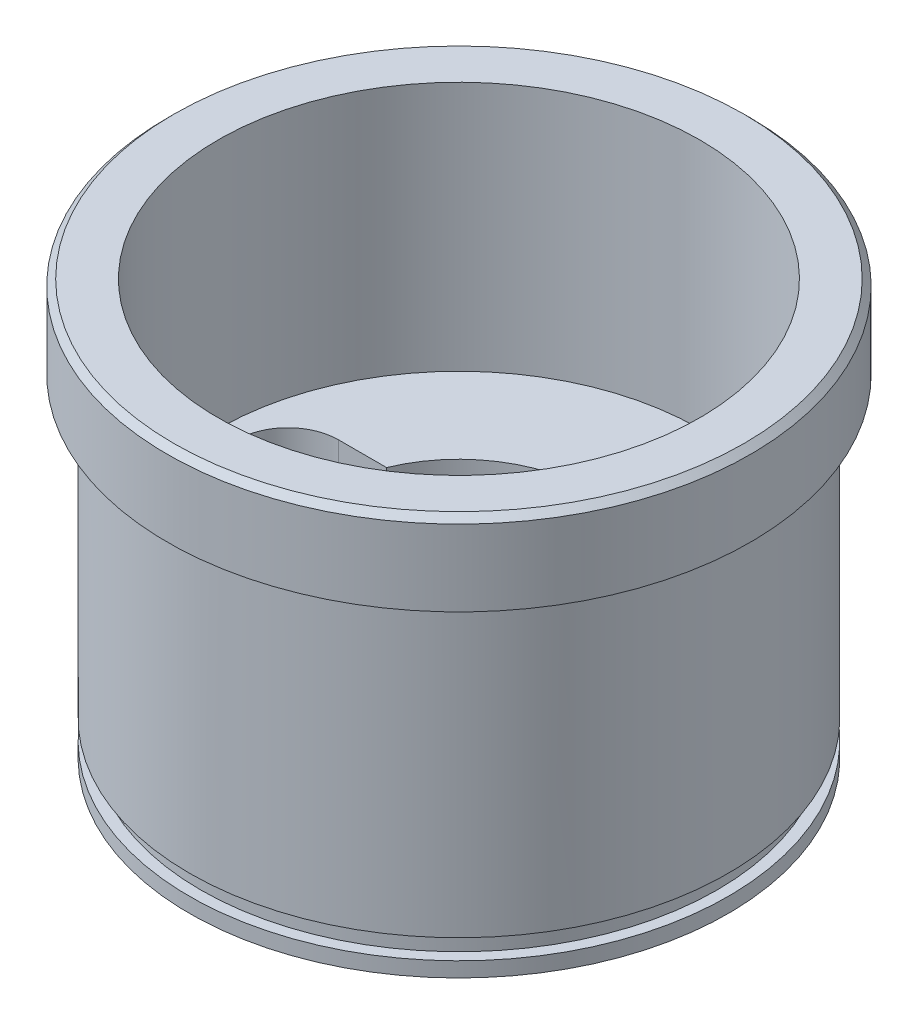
ISO-10303-21;
HEADER;
FILE_DESCRIPTION(('STEP AP214'),'2;1');
FILE_NAME('part.step','',(''),(''),'','','');
FILE_SCHEMA(('AUTOMOTIVE_DESIGN { 1 0 10303 214 1 1 1 1 }'));
ENDSEC;
DATA;
#1=APPLICATION_CONTEXT('core data for automotive mechanical design processes');
#2=APPLICATION_PROTOCOL_DEFINITION('international standard','automotive_design',2000,#1);
#3=PRODUCT_CONTEXT('',#1,'mechanical');
#4=PRODUCT('Part','Part','',(#3));
#5=PRODUCT_RELATED_PRODUCT_CATEGORY('part','',(#4));
#6=PRODUCT_DEFINITION_FORMATION('','',#4);
#7=PRODUCT_DEFINITION_CONTEXT('part definition',#1,'design');
#8=PRODUCT_DEFINITION('design','',#6,#7);
#9=PRODUCT_DEFINITION_SHAPE('','',#8);
#10=(LENGTH_UNIT() NAMED_UNIT(*) SI_UNIT(.MILLI.,.METRE.));
#11=(NAMED_UNIT(*) PLANE_ANGLE_UNIT() SI_UNIT($,.RADIAN.));
#12=(NAMED_UNIT(*) SI_UNIT($,.STERADIAN.) SOLID_ANGLE_UNIT());
#13=UNCERTAINTY_MEASURE_WITH_UNIT(LENGTH_MEASURE(1.E-05),#10,'distance_accuracy_value','');
#14=(GEOMETRIC_REPRESENTATION_CONTEXT(3) GLOBAL_UNCERTAINTY_ASSIGNED_CONTEXT((#13)) GLOBAL_UNIT_ASSIGNED_CONTEXT((#10,
#11,#12)) REPRESENTATION_CONTEXT('',''));
#15=CARTESIAN_POINT('',(0.,0.,0.));
#16=DIRECTION('',(0.,0.,1.));
#17=DIRECTION('',(1.,0.,0.));
#18=AXIS2_PLACEMENT_3D('',#15,#16,#17);
#19=CARTESIAN_POINT('',(0.,0.,0.));
#20=DIRECTION('',(0.,-1.,0.));
#21=DIRECTION('',(0.,0.,-1.));
#22=AXIS2_PLACEMENT_3D('',#19,#20,#21);
#23=CYLINDRICAL_SURFACE('',#22,42.5);
#24=CARTESIAN_POINT('',(0.,2.35,0.));
#25=DIRECTION('',(0.,-1.,0.));
#26=DIRECTION('',(0.,0.,-1.));
#27=AXIS2_PLACEMENT_3D('',#24,#25,#26);
#28=CIRCLE('',#27,42.5);
#29=CARTESIAN_POINT('',(0.,2.35,-42.5));
#30=VERTEX_POINT('',#29);
#31=EDGE_CURVE('E209',#30,#30,#28,.T.);
#32=ORIENTED_EDGE('',*,*,#31,.T.);
#33=EDGE_LOOP('',(#32));
#34=FACE_BOUND('',#33,.T.);
#35=CARTESIAN_POINT('',(0.,0.,0.));
#36=DIRECTION('',(0.,-1.,0.));
#37=DIRECTION('',(0.,0.,-1.));
#38=AXIS2_PLACEMENT_3D('',#35,#36,#37);
#39=CIRCLE('',#38,42.5);
#40=CARTESIAN_POINT('',(0.,0.,-42.5));
#41=VERTEX_POINT('',#40);
#42=EDGE_CURVE('E222',#41,#41,#39,.T.);
#43=ORIENTED_EDGE('',*,*,#42,.F.);
#44=EDGE_LOOP('',(#43));
#45=FACE_BOUND('',#44,.T.);
#46=ADVANCED_FACE('F31',(#34,#45),#23,.T.);
#47=CARTESIAN_POINT('',(0.,0.,0.));
#48=DIRECTION('',(0.,-1.,0.));
#49=DIRECTION('',(0.,0.,-1.));
#50=AXIS2_PLACEMENT_3D('',#47,#48,#49);
#51=CYLINDRICAL_SURFACE('',#50,33.);
#52=CARTESIAN_POINT('',(0.,0.866025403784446,0.));
#53=DIRECTION('',(0.,1.,0.));
#54=DIRECTION('',(0.,0.,1.));
#55=AXIS2_PLACEMENT_3D('',#52,#53,#54);
#56=CIRCLE('',#55,33.);
#57=CARTESIAN_POINT('',(0.,0.866025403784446,33.));
#58=VERTEX_POINT('',#57);
#59=EDGE_CURVE('E253',#58,#58,#56,.F.);
#60=ORIENTED_EDGE('',*,*,#59,.T.);
#61=EDGE_LOOP('',(#60));
#62=FACE_BOUND('',#61,.T.);
#63=CARTESIAN_POINT('',(0.,5.,0.));
#64=DIRECTION('',(0.,1.,0.));
#65=DIRECTION('',(0.,0.,1.));
#66=AXIS2_PLACEMENT_3D('',#63,#64,#65);
#67=CIRCLE('',#66,33.);
#68=CARTESIAN_POINT('',(0.,5.,33.));
#69=VERTEX_POINT('',#68);
#70=EDGE_CURVE('E223',#69,#69,#67,.F.);
#71=ORIENTED_EDGE('',*,*,#70,.F.);
#72=EDGE_LOOP('',(#71));
#73=FACE_BOUND('',#72,.T.);
#74=ADVANCED_FACE('F323',(#62,#73),#51,.F.);
#75=CARTESIAN_POINT('',(0.,14.,0.));
#76=DIRECTION('',(0.,-1.,0.));
#77=DIRECTION('',(0.,0.,-1.));
#78=AXIS2_PLACEMENT_3D('',#75,#76,#77);
#79=CIRCLE('',#78,33.);
#80=CARTESIAN_POINT('',(0.,14.,-33.));
#81=VERTEX_POINT('',#80);
#82=EDGE_CURVE('E226',#81,#81,#79,.T.);
#83=ORIENTED_EDGE('',*,*,#82,.F.);
#84=EDGE_LOOP('',(#83));
#85=FACE_BOUND('',#84,.T.);
#86=CARTESIAN_POINT('',(0.,9.77,0.));
#87=DIRECTION('',(0.,-1.,0.));
#88=DIRECTION('',(0.,0.,-1.));
#89=AXIS2_PLACEMENT_3D('',#86,#87,#88);
#90=CIRCLE('',#89,33.);
#91=CARTESIAN_POINT('',(0.,9.77,-33.));
#92=VERTEX_POINT('',#91);
#93=EDGE_CURVE('E218',#92,#92,#90,.F.);
#94=ORIENTED_EDGE('',*,*,#93,.F.);
#95=EDGE_LOOP('',(#94));
#96=FACE_BOUND('',#95,.T.);
#97=ADVANCED_FACE('F332',(#85,#96),#51,.F.);
#98=CARTESIAN_POINT('',(-46.,52.5,0.));
#99=DIRECTION('',(0.,1.,0.));
#100=DIRECTION('',(0.,0.,1.));
#101=AXIS2_PLACEMENT_3D('',#98,#99,#100);
#102=PLANE('',#101);
#103=CARTESIAN_POINT('',(0.,52.5,0.));
#104=DIRECTION('',(0.,-1.,0.));
#105=DIRECTION('',(0.,0.,-1.));
#106=AXIS2_PLACEMENT_3D('',#103,#104,#105);
#107=CIRCLE('',#106,42.5);
#108=CARTESIAN_POINT('',(0.,52.5,-42.5));
#109=VERTEX_POINT('',#108);
#110=EDGE_CURVE('E219',#109,#109,#107,.T.);
#111=ORIENTED_EDGE('',*,*,#110,.F.);
#112=EDGE_LOOP('',(#111));
#113=FACE_BOUND('',#112,.T.);
#114=CARTESIAN_POINT('',(0.,52.5,0.));
#115=DIRECTION('',(0.,-1.,0.));
#116=DIRECTION('',(0.,0.,-1.));
#117=AXIS2_PLACEMENT_3D('',#114,#115,#116);
#118=CIRCLE('',#117,46.);
#119=CARTESIAN_POINT('',(0.,52.5,-46.));
#120=VERTEX_POINT('',#119);
#121=EDGE_CURVE('E238',#120,#120,#118,.T.);
#122=ORIENTED_EDGE('',*,*,#121,.T.);
#123=EDGE_LOOP('',(#122));
#124=FACE_BOUND('',#123,.T.);
#125=ADVANCED_FACE('F33',(#113,#124),#102,.F.);
#126=CARTESIAN_POINT('',(0.,0.,0.));
#127=DIRECTION('',(0.,-1.,0.));
#128=DIRECTION('',(0.,0.,-1.));
#129=AXIS2_PLACEMENT_3D('',#126,#127,#128);
#130=CYLINDRICAL_SURFACE('',#129,46.);
#131=CARTESIAN_POINT('',(0.,64.5,0.));
#132=DIRECTION('',(0.,-1.,0.));
#133=DIRECTION('',(0.,0.,-1.));
#134=AXIS2_PLACEMENT_3D('',#131,#132,#133);
#135=CIRCLE('',#134,46.);
#136=CARTESIAN_POINT('',(0.,64.5,-46.));
#137=VERTEX_POINT('',#136);
#138=EDGE_CURVE('E241',#137,#137,#135,.T.);
#139=ORIENTED_EDGE('',*,*,#138,.T.);
#140=EDGE_LOOP('',(#139));
#141=FACE_BOUND('',#140,.T.);
#142=ORIENTED_EDGE('',*,*,#121,.F.);
#143=EDGE_LOOP('',(#142));
#144=FACE_BOUND('',#143,.T.);
#145=ADVANCED_FACE('F356',(#141,#144),#130,.T.);
#146=CARTESIAN_POINT('',(-38.,65.5,0.));
#147=DIRECTION('',(0.,-1.,0.));
#148=DIRECTION('',(0.,0.,-1.));
#149=AXIS2_PLACEMENT_3D('',#146,#147,#148);
#150=PLANE('',#149);
#151=CARTESIAN_POINT('',(0.,65.5,0.));
#152=DIRECTION('',(0.,-1.,0.));
#153=DIRECTION('',(0.,0.,-1.));
#154=AXIS2_PLACEMENT_3D('',#151,#152,#153);
#155=CIRCLE('',#154,45.);
#156=CARTESIAN_POINT('',(0.,65.5,-45.));
#157=VERTEX_POINT('',#156);
#158=EDGE_CURVE('E244',#157,#157,#155,.F.);
#159=ORIENTED_EDGE('',*,*,#158,.T.);
#160=EDGE_LOOP('',(#159));
#161=FACE_BOUND('',#160,.T.);
#162=CARTESIAN_POINT('',(0.,65.5,0.));
#163=DIRECTION('',(0.,-1.,0.));
#164=DIRECTION('',(0.,0.,-1.));
#165=AXIS2_PLACEMENT_3D('',#162,#163,#164);
#166=CIRCLE('',#165,38.);
#167=CARTESIAN_POINT('',(0.,65.5,-38.));
#168=VERTEX_POINT('',#167);
#169=EDGE_CURVE('E235',#168,#168,#166,.T.);
#170=ORIENTED_EDGE('',*,*,#169,.T.);
#171=EDGE_LOOP('',(#170));
#172=FACE_BOUND('',#171,.T.);
#173=ADVANCED_FACE('F360',(#161,#172),#150,.F.);
#174=CARTESIAN_POINT('',(0.,0.,0.));
#175=DIRECTION('',(0.,-1.,0.));
#176=DIRECTION('',(0.,0.,-1.));
#177=AXIS2_PLACEMENT_3D('',#174,#175,#176);
#178=CYLINDRICAL_SURFACE('',#177,38.);
#179=ORIENTED_EDGE('',*,*,#169,.F.);
#180=EDGE_LOOP('',(#179));
#181=FACE_BOUND('',#180,.T.);
#182=CARTESIAN_POINT('',(0.,26.,0.));
#183=DIRECTION('',(0.,-1.,0.));
#184=DIRECTION('',(0.,0.,-1.));
#185=AXIS2_PLACEMENT_3D('',#182,#183,#184);
#186=CIRCLE('',#185,38.);
#187=CARTESIAN_POINT('',(0.,26.,-38.));
#188=VERTEX_POINT('',#187);
#189=EDGE_CURVE('E231',#188,#188,#186,.T.);
#190=ORIENTED_EDGE('',*,*,#189,.T.);
#191=EDGE_LOOP('',(#190));
#192=FACE_BOUND('',#191,.T.);
#193=ADVANCED_FACE('F366',(#181,#192),#178,.F.);
#194=CARTESIAN_POINT('',(-21.,26.,0.));
#195=DIRECTION('',(0.,-1.,0.));
#196=DIRECTION('',(0.,0.,-1.));
#197=AXIS2_PLACEMENT_3D('',#194,#195,#196);
#198=PLANE('',#197);
#199=ORIENTED_EDGE('',*,*,#189,.F.);
#200=EDGE_LOOP('',(#199));
#201=FACE_BOUND('',#200,.T.);
#202=CARTESIAN_POINT('',(13.5000000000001,26.,23.3826859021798));
#203=DIRECTION('',(0.,1.,0.));
#204=DIRECTION('',(0.866025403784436,0.,-0.500000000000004));
#205=AXIS2_PLACEMENT_3D('',#202,#203,#204);
#206=CIRCLE('',#205,8.);
#207=CARTESIAN_POINT('',(6.57179676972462,26.,27.3826859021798));
#208=VERTEX_POINT('',#207);
#209=CARTESIAN_POINT('',(20.4282032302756,26.,19.3826859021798));
#210=VERTEX_POINT('',#209);
#211=EDGE_CURVE('E154',#208,#210,#206,.T.);
#212=ORIENTED_EDGE('',*,*,#211,.F.);
#213=DIRECTION('',(0.500000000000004,0.,0.866025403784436));
#214=VECTOR('',#213,1.);
#215=CARTESIAN_POINT('',(6.57179676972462,26.,27.3826859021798));
#216=LINE('',#215,#214);
#217=CARTESIAN_POINT('',(2.78004068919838,26.,20.8151717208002));
#218=VERTEX_POINT('',#217);
#219=EDGE_CURVE('E160',#218,#208,#216,.T.);
#220=ORIENTED_EDGE('',*,*,#219,.F.);
#221=CARTESIAN_POINT('',(0.,26.,0.));
#222=DIRECTION('',(0.,-1.,0.));
#223=DIRECTION('',(0.,0.,-1.));
#224=AXIS2_PLACEMENT_3D('',#221,#222,#223);
#225=CIRCLE('',#224,21.);
#226=CARTESIAN_POINT('',(-19.4164878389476,26.,8.));
#227=VERTEX_POINT('',#226);
#228=EDGE_CURVE('E229',#218,#227,#225,.T.);
#229=ORIENTED_EDGE('',*,*,#228,.T.);
#230=DIRECTION('',(1.,0.,0.));
#231=VECTOR('',#230,1.);
#232=CARTESIAN_POINT('',(-27.,26.,8.));
#233=LINE('',#232,#231);
#234=CARTESIAN_POINT('',(-27.,26.,8.));
#235=VERTEX_POINT('',#234);
#236=EDGE_CURVE('E181',#235,#227,#233,.T.);
#237=ORIENTED_EDGE('',*,*,#236,.F.);
#238=CARTESIAN_POINT('',(-27.,26.,0.));
#239=DIRECTION('',(0.,1.,0.));
#240=DIRECTION('',(0.,0.,1.));
#241=AXIS2_PLACEMENT_3D('',#238,#239,#240);
#242=CIRCLE('',#241,8.);
#243=CARTESIAN_POINT('',(-27.,26.,-8.));
#244=VERTEX_POINT('',#243);
#245=EDGE_CURVE('E178',#244,#235,#242,.T.);
#246=ORIENTED_EDGE('',*,*,#245,.F.);
#247=DIRECTION('',(-1.,0.,0.));
#248=VECTOR('',#247,1.);
#249=CARTESIAN_POINT('',(-27.,26.,-8.));
#250=LINE('',#249,#248);
#251=CARTESIAN_POINT('',(-19.4164878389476,26.,-8.));
#252=VERTEX_POINT('',#251);
#253=EDGE_CURVE('E184',#252,#244,#250,.T.);
#254=ORIENTED_EDGE('',*,*,#253,.F.);
#255=CARTESIAN_POINT('',(2.7800406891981,26.,-20.8151717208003));
#256=VERTEX_POINT('',#255);
#257=EDGE_CURVE('E144',#252,#256,#225,.T.);
#258=ORIENTED_EDGE('',*,*,#257,.T.);
#259=DIRECTION('',(-0.499999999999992,0.,0.866025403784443));
#260=VECTOR('',#259,1.);
#261=CARTESIAN_POINT('',(6.57179676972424,26.,-27.3826859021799));
#262=LINE('',#261,#260);
#263=CARTESIAN_POINT('',(6.57179676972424,26.,-27.3826859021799));
#264=VERTEX_POINT('',#263);
#265=EDGE_CURVE('E54',#264,#256,#262,.T.);
#266=ORIENTED_EDGE('',*,*,#265,.F.);
#267=CARTESIAN_POINT('',(13.4999999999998,26.,-23.38268590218));
#268=DIRECTION('',(0.,1.,0.));
#269=DIRECTION('',(-0.866025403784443,0.,-0.499999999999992));
#270=AXIS2_PLACEMENT_3D('',#267,#268,#269);
#271=CIRCLE('',#270,8.);
#272=CARTESIAN_POINT('',(20.4282032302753,26.,-19.38268590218));
#273=VERTEX_POINT('',#272);
#274=EDGE_CURVE('E132',#273,#264,#271,.T.);
#275=ORIENTED_EDGE('',*,*,#274,.F.);
#276=DIRECTION('',(0.499999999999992,0.,-0.866025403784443));
#277=VECTOR('',#276,1.);
#278=CARTESIAN_POINT('',(20.4282032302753,26.,-19.38268590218));
#279=LINE('',#278,#277);
#280=CARTESIAN_POINT('',(16.6364471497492,26.,-12.8151717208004));
#281=VERTEX_POINT('',#280);
#282=EDGE_CURVE('E145',#281,#273,#279,.T.);
#283=ORIENTED_EDGE('',*,*,#282,.F.);
#284=CARTESIAN_POINT('',(16.6364471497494,26.,12.8151717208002));
#285=VERTEX_POINT('',#284);
#286=EDGE_CURVE('E232',#281,#285,#225,.T.);
#287=ORIENTED_EDGE('',*,*,#286,.T.);
#288=DIRECTION('',(-0.500000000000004,0.,-0.866025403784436));
#289=VECTOR('',#288,1.);
#290=CARTESIAN_POINT('',(20.4282032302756,26.,19.3826859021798));
#291=LINE('',#290,#289);
#292=EDGE_CURVE('E158',#210,#285,#291,.T.);
#293=ORIENTED_EDGE('',*,*,#292,.F.);
#294=EDGE_LOOP('',(#212,#220,#229,#237,#246,#254,#258,#266,#275,#283,#287,#293));
#295=FACE_BOUND('',#294,.T.);
#296=ADVANCED_FACE('F141',(#201,#295),#198,.F.);
#297=CARTESIAN_POINT('',(0.,0.,0.));
#298=DIRECTION('',(0.,-1.,0.));
#299=DIRECTION('',(0.,0.,-1.));
#300=AXIS2_PLACEMENT_3D('',#297,#298,#299);
#301=CYLINDRICAL_SURFACE('',#300,21.);
#302=ORIENTED_EDGE('',*,*,#228,.F.);
#303=DIRECTION('',(0.,-1.,0.));
#304=VECTOR('',#303,1.);
#305=CARTESIAN_POINT('',(2.78004068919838,0.,20.8151717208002));
#306=LINE('',#305,#304);
#307=CARTESIAN_POINT('',(2.78004068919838,19.,20.8151717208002));
#308=VERTEX_POINT('',#307);
#309=EDGE_CURVE('E11',#218,#308,#306,.T.);
#310=ORIENTED_EDGE('',*,*,#309,.T.);
#311=CARTESIAN_POINT('',(0.,19.,0.));
#312=DIRECTION('',(0.,1.,0.));
#313=DIRECTION('',(0.,0.,1.));
#314=AXIS2_PLACEMENT_3D('',#311,#312,#313);
#315=CIRCLE('',#314,21.);
#316=CARTESIAN_POINT('',(16.6364471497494,19.,12.8151717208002));
#317=VERTEX_POINT('',#316);
#318=EDGE_CURVE('E280',#317,#308,#315,.F.);
#319=ORIENTED_EDGE('',*,*,#318,.F.);
#320=DIRECTION('',(0.,-1.,0.));
#321=VECTOR('',#320,1.);
#322=CARTESIAN_POINT('',(16.6364471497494,0.,12.8151717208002));
#323=LINE('',#322,#321);
#324=EDGE_CURVE('E39',#317,#285,#323,.F.);
#325=ORIENTED_EDGE('',*,*,#324,.T.);
#326=ORIENTED_EDGE('',*,*,#286,.F.);
#327=DIRECTION('',(0.,-1.,0.));
#328=VECTOR('',#327,1.);
#329=CARTESIAN_POINT('',(16.6364471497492,0.,-12.8151717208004));
#330=LINE('',#329,#328);
#331=CARTESIAN_POINT('',(16.6364471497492,19.,-12.8151717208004));
#332=VERTEX_POINT('',#331);
#333=EDGE_CURVE('E279',#281,#332,#330,.T.);
#334=ORIENTED_EDGE('',*,*,#333,.T.);
#335=CARTESIAN_POINT('',(2.7800406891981,19.,-20.8151717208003));
#336=VERTEX_POINT('',#335);
#337=EDGE_CURVE('E277',#336,#332,#315,.F.);
#338=ORIENTED_EDGE('',*,*,#337,.F.);
#339=DIRECTION('',(0.,-1.,0.));
#340=VECTOR('',#339,1.);
#341=CARTESIAN_POINT('',(2.7800406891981,0.,-20.8151717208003));
#342=LINE('',#341,#340);
#343=EDGE_CURVE('E275',#336,#256,#342,.F.);
#344=ORIENTED_EDGE('',*,*,#343,.T.);
#345=ORIENTED_EDGE('',*,*,#257,.F.);
#346=DIRECTION('',(0.,-1.,0.));
#347=VECTOR('',#346,1.);
#348=CARTESIAN_POINT('',(-19.4164878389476,0.,-8.));
#349=LINE('',#348,#347);
#350=CARTESIAN_POINT('',(-19.4164878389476,19.,-8.));
#351=VERTEX_POINT('',#350);
#352=EDGE_CURVE('E272',#252,#351,#349,.T.);
#353=ORIENTED_EDGE('',*,*,#352,.T.);
#354=CARTESIAN_POINT('',(0.,19.,0.));
#355=DIRECTION('',(0.,1.,0.));
#356=DIRECTION('',(0.,0.,1.));
#357=AXIS2_PLACEMENT_3D('',#354,#355,#356);
#358=CIRCLE('',#357,21.);
#359=CARTESIAN_POINT('',(-19.4164878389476,19.,8.));
#360=VERTEX_POINT('',#359);
#361=EDGE_CURVE('E259',#360,#351,#358,.F.);
#362=ORIENTED_EDGE('',*,*,#361,.F.);
#363=DIRECTION('',(0.,-1.,0.));
#364=VECTOR('',#363,1.);
#365=CARTESIAN_POINT('',(-19.4164878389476,0.,8.));
#366=LINE('',#365,#364);
#367=EDGE_CURVE('E269',#360,#227,#366,.F.);
#368=ORIENTED_EDGE('',*,*,#367,.T.);
#369=EDGE_LOOP('',(#302,#310,#319,#325,#326,#334,#338,#344,#345,#353,#362,#368));
#370=FACE_BOUND('',#369,.T.);
#371=CARTESIAN_POINT('',(0.,15.,0.));
#372=DIRECTION('',(0.,1.,0.));
#373=DIRECTION('',(0.,0.,1.));
#374=AXIS2_PLACEMENT_3D('',#371,#372,#373);
#375=CIRCLE('',#374,21.);
#376=CARTESIAN_POINT('',(0.,15.,21.));
#377=VERTEX_POINT('',#376);
#378=EDGE_CURVE('E247',#377,#377,#375,.F.);
#379=ORIENTED_EDGE('',*,*,#378,.T.);
#380=EDGE_LOOP('',(#379));
#381=FACE_BOUND('',#380,.T.);
#382=ADVANCED_FACE('F295',(#370,#381),#301,.F.);
#383=CARTESIAN_POINT('',(-33.,14.,0.));
#384=DIRECTION('',(0.,1.,0.));
#385=DIRECTION('',(0.,0.,1.));
#386=AXIS2_PLACEMENT_3D('',#383,#384,#385);
#387=PLANE('',#386);
#388=CARTESIAN_POINT('',(13.4999999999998,14.,-23.38268590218));
#389=DIRECTION('',(0.,1.,0.));
#390=DIRECTION('',(0.,0.,1.));
#391=AXIS2_PLACEMENT_3D('',#388,#389,#390);
#392=CIRCLE('',#391,3.5);
#393=CARTESIAN_POINT('',(13.4999999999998,14.,-19.88268590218));
#394=VERTEX_POINT('',#393);
#395=EDGE_CURVE('E385',#394,#394,#392,.F.);
#396=ORIENTED_EDGE('',*,*,#395,.F.);
#397=EDGE_LOOP('',(#396));
#398=FACE_BOUND('',#397,.T.);
#399=CARTESIAN_POINT('',(13.5000000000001,14.,23.3826859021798));
#400=DIRECTION('',(0.,1.,0.));
#401=DIRECTION('',(0.,0.,1.));
#402=AXIS2_PLACEMENT_3D('',#399,#400,#401);
#403=CIRCLE('',#402,3.5);
#404=CARTESIAN_POINT('',(13.5000000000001,14.,26.8826859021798));
#405=VERTEX_POINT('',#404);
#406=EDGE_CURVE('E137',#405,#405,#403,.F.);
#407=ORIENTED_EDGE('',*,*,#406,.F.);
#408=EDGE_LOOP('',(#407));
#409=FACE_BOUND('',#408,.T.);
#410=CARTESIAN_POINT('',(-27.,14.,0.));
#411=DIRECTION('',(0.,1.,0.));
#412=DIRECTION('',(0.,0.,1.));
#413=AXIS2_PLACEMENT_3D('',#410,#411,#412);
#414=CIRCLE('',#413,3.5);
#415=CARTESIAN_POINT('',(-27.,14.,3.5));
#416=VERTEX_POINT('',#415);
#417=EDGE_CURVE('E175',#416,#416,#414,.F.);
#418=ORIENTED_EDGE('',*,*,#417,.F.);
#419=EDGE_LOOP('',(#418));
#420=FACE_BOUND('',#419,.T.);
#421=CARTESIAN_POINT('',(0.,14.,0.));
#422=DIRECTION('',(0.,1.,0.));
#423=DIRECTION('',(0.,0.,1.));
#424=AXIS2_PLACEMENT_3D('',#421,#422,#423);
#425=CIRCLE('',#424,22.);
#426=CARTESIAN_POINT('',(0.,14.,22.));
#427=VERTEX_POINT('',#426);
#428=EDGE_CURVE('E250',#427,#427,#425,.T.);
#429=ORIENTED_EDGE('',*,*,#428,.T.);
#430=EDGE_LOOP('',(#429));
#431=FACE_BOUND('',#430,.T.);
#432=ORIENTED_EDGE('',*,*,#82,.T.);
#433=EDGE_LOOP('',(#432));
#434=FACE_BOUND('',#433,.T.);
#435=ADVANCED_FACE('F348',(#398,#409,#420,#431,#434),#387,.F.);
#436=CARTESIAN_POINT('',(-42.5,0.,0.));
#437=DIRECTION('',(0.,1.,0.));
#438=DIRECTION('',(0.,0.,1.));
#439=AXIS2_PLACEMENT_3D('',#436,#437,#438);
#440=PLANE('',#439);
#441=CARTESIAN_POINT('',(0.,0.,0.));
#442=DIRECTION('',(0.,1.,0.));
#443=DIRECTION('',(0.,0.,1.));
#444=AXIS2_PLACEMENT_3D('',#441,#442,#443);
#445=CIRCLE('',#444,34.5);
#446=CARTESIAN_POINT('',(0.,0.,34.5));
#447=VERTEX_POINT('',#446);
#448=EDGE_CURVE('E256',#447,#447,#445,.T.);
#449=ORIENTED_EDGE('',*,*,#448,.T.);
#450=EDGE_LOOP('',(#449));
#451=FACE_BOUND('',#450,.T.);
#452=ORIENTED_EDGE('',*,*,#42,.T.);
#453=EDGE_LOOP('',(#452));
#454=FACE_BOUND('',#453,.T.);
#455=ADVANCED_FACE('F339',(#451,#454),#440,.F.);
#456=CARTESIAN_POINT('',(0.,5.5,0.));
#457=DIRECTION('',(0.,1.,0.));
#458=DIRECTION('',(0.,0.,1.));
#459=AXIS2_PLACEMENT_3D('',#456,#457,#458);
#460=CIRCLE('',#459,42.5);
#461=CARTESIAN_POINT('',(0.,5.5,42.5));
#462=VERTEX_POINT('',#461);
#463=EDGE_CURVE('E204',#462,#462,#460,.T.);
#464=ORIENTED_EDGE('',*,*,#463,.T.);
#465=EDGE_LOOP('',(#464));
#466=FACE_BOUND('',#465,.T.);
#467=ORIENTED_EDGE('',*,*,#110,.T.);
#468=EDGE_LOOP('',(#467));
#469=FACE_BOUND('',#468,.T.);
#470=ADVANCED_FACE('F326',(#466,#469),#23,.T.);
#471=CARTESIAN_POINT('',(0.,64.5,0.));
#472=DIRECTION('',(0.,-1.,0.));
#473=DIRECTION('',(0.,0.,-1.));
#474=AXIS2_PLACEMENT_3D('',#471,#472,#473);
#475=CONICAL_SURFACE('',#474,46.,0.785398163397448);
#476=ORIENTED_EDGE('',*,*,#158,.F.);
#477=EDGE_LOOP('',(#476));
#478=FACE_BOUND('',#477,.T.);
#479=ORIENTED_EDGE('',*,*,#138,.F.);
#480=EDGE_LOOP('',(#479));
#481=FACE_BOUND('',#480,.T.);
#482=ADVANCED_FACE('F338',(#478,#481),#475,.T.);
#483=CARTESIAN_POINT('',(0.,15.,0.));
#484=DIRECTION('',(0.,-1.,0.));
#485=DIRECTION('',(0.,0.,-1.));
#486=AXIS2_PLACEMENT_3D('',#483,#484,#485);
#487=CONICAL_SURFACE('',#486,21.,0.785398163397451);
#488=ORIENTED_EDGE('',*,*,#428,.F.);
#489=EDGE_LOOP('',(#488));
#490=FACE_BOUND('',#489,.T.);
#491=ORIENTED_EDGE('',*,*,#378,.F.);
#492=EDGE_LOOP('',(#491));
#493=FACE_BOUND('',#492,.T.);
#494=ADVANCED_FACE('F345',(#490,#493),#487,.F.);
#495=CARTESIAN_POINT('',(0.,0.866025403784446,0.));
#496=DIRECTION('',(0.,-1.,0.));
#497=DIRECTION('',(0.,0.,-1.));
#498=AXIS2_PLACEMENT_3D('',#495,#496,#497);
#499=CONICAL_SURFACE('',#498,33.,1.0471975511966);
#500=ORIENTED_EDGE('',*,*,#448,.F.);
#501=EDGE_LOOP('',(#500));
#502=FACE_BOUND('',#501,.T.);
#503=ORIENTED_EDGE('',*,*,#59,.F.);
#504=EDGE_LOOP('',(#503));
#505=FACE_BOUND('',#504,.T.);
#506=ADVANCED_FACE('F412',(#502,#505),#499,.F.);
#507=CARTESIAN_POINT('',(-34.86,5.,0.));
#508=DIRECTION('',(0.,1.,0.));
#509=DIRECTION('',(0.,0.,1.));
#510=AXIS2_PLACEMENT_3D('',#507,#508,#509);
#511=PLANE('',#510);
#512=CARTESIAN_POINT('',(0.,5.,0.));
#513=DIRECTION('',(0.,-1.,0.));
#514=DIRECTION('',(0.,0.,-1.));
#515=AXIS2_PLACEMENT_3D('',#512,#513,#514);
#516=CIRCLE('',#515,34.86);
#517=CARTESIAN_POINT('',(0.,5.,-34.86));
#518=VERTEX_POINT('',#517);
#519=EDGE_CURVE('E215',#518,#518,#516,.T.);
#520=ORIENTED_EDGE('',*,*,#519,.F.);
#521=EDGE_LOOP('',(#520));
#522=FACE_BOUND('',#521,.T.);
#523=ORIENTED_EDGE('',*,*,#70,.T.);
#524=EDGE_LOOP('',(#523));
#525=FACE_BOUND('',#524,.T.);
#526=ADVANCED_FACE('F402',(#522,#525),#511,.T.);
#527=CARTESIAN_POINT('',(-34.86,9.77,0.));
#528=DIRECTION('',(0.,-1.,0.));
#529=DIRECTION('',(0.,0.,-1.));
#530=AXIS2_PLACEMENT_3D('',#527,#528,#529);
#531=PLANE('',#530);
#532=CARTESIAN_POINT('',(0.,9.77,0.));
#533=DIRECTION('',(0.,-1.,0.));
#534=DIRECTION('',(0.,0.,-1.));
#535=AXIS2_PLACEMENT_3D('',#532,#533,#534);
#536=CIRCLE('',#535,34.86);
#537=CARTESIAN_POINT('',(0.,9.77,-34.86));
#538=VERTEX_POINT('',#537);
#539=EDGE_CURVE('E205',#538,#538,#536,.T.);
#540=ORIENTED_EDGE('',*,*,#539,.T.);
#541=EDGE_LOOP('',(#540));
#542=FACE_BOUND('',#541,.T.);
#543=ORIENTED_EDGE('',*,*,#93,.T.);
#544=EDGE_LOOP('',(#543));
#545=FACE_BOUND('',#544,.T.);
#546=ADVANCED_FACE('F399',(#542,#545),#531,.T.);
#547=CARTESIAN_POINT('',(0.,6.,0.));
#548=DIRECTION('',(0.,-1.,0.));
#549=DIRECTION('',(0.,0.,-1.));
#550=AXIS2_PLACEMENT_3D('',#547,#548,#549);
#551=TOROIDAL_SURFACE('',#550,34.86,1.);
#552=ORIENTED_EDGE('',*,*,#519,.T.);
#553=EDGE_LOOP('',(#552));
#554=FACE_BOUND('',#553,.T.);
#555=CARTESIAN_POINT('',(0.,6.00000000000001,0.));
#556=DIRECTION('',(0.,-1.,0.));
#557=DIRECTION('',(0.,0.,-1.));
#558=AXIS2_PLACEMENT_3D('',#555,#556,#557);
#559=CIRCLE('',#558,35.86);
#560=CARTESIAN_POINT('',(0.,6.00000000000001,-35.86));
#561=VERTEX_POINT('',#560);
#562=EDGE_CURVE('E212',#561,#561,#559,.T.);
#563=ORIENTED_EDGE('',*,*,#562,.F.);
#564=EDGE_LOOP('',(#563));
#565=FACE_BOUND('',#564,.T.);
#566=ADVANCED_FACE('F401',(#554,#565),#551,.F.);
#567=CARTESIAN_POINT('',(0.,0.,0.));
#568=DIRECTION('',(0.,-1.,0.));
#569=DIRECTION('',(0.,0.,-1.));
#570=AXIS2_PLACEMENT_3D('',#567,#568,#569);
#571=CYLINDRICAL_SURFACE('',#570,35.86);
#572=ORIENTED_EDGE('',*,*,#562,.T.);
#573=EDGE_LOOP('',(#572));
#574=FACE_BOUND('',#573,.T.);
#575=CARTESIAN_POINT('',(0.,8.76999999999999,0.));
#576=DIRECTION('',(0.,-1.,0.));
#577=DIRECTION('',(0.,0.,-1.));
#578=AXIS2_PLACEMENT_3D('',#575,#576,#577);
#579=CIRCLE('',#578,35.86);
#580=CARTESIAN_POINT('',(0.,8.76999999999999,-35.86));
#581=VERTEX_POINT('',#580);
#582=EDGE_CURVE('E208',#581,#581,#579,.T.);
#583=ORIENTED_EDGE('',*,*,#582,.F.);
#584=EDGE_LOOP('',(#583));
#585=FACE_BOUND('',#584,.T.);
#586=ADVANCED_FACE('F409',(#574,#585),#571,.F.);
#587=CARTESIAN_POINT('',(0.,8.77,0.));
#588=DIRECTION('',(0.,-1.,0.));
#589=DIRECTION('',(0.,0.,-1.));
#590=AXIS2_PLACEMENT_3D('',#587,#588,#589);
#591=TOROIDAL_SURFACE('',#590,34.86,1.);
#592=ORIENTED_EDGE('',*,*,#582,.T.);
#593=EDGE_LOOP('',(#592));
#594=FACE_BOUND('',#593,.T.);
#595=ORIENTED_EDGE('',*,*,#539,.F.);
#596=EDGE_LOOP('',(#595));
#597=FACE_BOUND('',#596,.T.);
#598=ADVANCED_FACE('F419',(#594,#597),#591,.F.);
#599=CARTESIAN_POINT('',(-53.4212962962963,2.35,0.));
#600=DIRECTION('',(0.,-1.,0.));
#601=DIRECTION('',(0.,0.,-1.));
#602=AXIS2_PLACEMENT_3D('',#599,#600,#601);
#603=PLANE('',#602);
#604=CARTESIAN_POINT('',(0.,2.35,0.));
#605=DIRECTION('',(0.,1.,0.));
#606=DIRECTION('',(0.,0.,1.));
#607=AXIS2_PLACEMENT_3D('',#604,#605,#606);
#608=CIRCLE('',#607,40.75);
#609=CARTESIAN_POINT('',(0.,2.35,40.75));
#610=VERTEX_POINT('',#609);
#611=EDGE_CURVE('E201',#610,#610,#608,.T.);
#612=ORIENTED_EDGE('',*,*,#611,.F.);
#613=EDGE_LOOP('',(#612));
#614=FACE_BOUND('',#613,.T.);
#615=ORIENTED_EDGE('',*,*,#31,.F.);
#616=EDGE_LOOP('',(#615));
#617=FACE_BOUND('',#616,.T.);
#618=ADVANCED_FACE('F417',(#614,#617),#603,.F.);
#619=CARTESIAN_POINT('',(-53.4212962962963,5.5,0.));
#620=DIRECTION('',(0.,1.,0.));
#621=DIRECTION('',(0.,0.,1.));
#622=AXIS2_PLACEMENT_3D('',#619,#620,#621);
#623=PLANE('',#622);
#624=CARTESIAN_POINT('',(0.,5.5,0.));
#625=DIRECTION('',(0.,1.,0.));
#626=DIRECTION('',(0.,0.,1.));
#627=AXIS2_PLACEMENT_3D('',#624,#625,#626);
#628=CIRCLE('',#627,40.75);
#629=CARTESIAN_POINT('',(0.,5.5,40.75));
#630=VERTEX_POINT('',#629);
#631=EDGE_CURVE('E197',#630,#630,#628,.T.);
#632=ORIENTED_EDGE('',*,*,#631,.T.);
#633=EDGE_LOOP('',(#632));
#634=FACE_BOUND('',#633,.T.);
#635=ORIENTED_EDGE('',*,*,#463,.F.);
#636=EDGE_LOOP('',(#635));
#637=FACE_BOUND('',#636,.T.);
#638=ADVANCED_FACE('F478',(#634,#637),#623,.F.);
#639=CARTESIAN_POINT('',(0.,0.,0.));
#640=DIRECTION('',(0.,1.,0.));
#641=DIRECTION('',(0.,0.,1.));
#642=AXIS2_PLACEMENT_3D('',#639,#640,#641);
#643=CYLINDRICAL_SURFACE('',#642,40.75);
#644=ORIENTED_EDGE('',*,*,#631,.F.);
#645=EDGE_LOOP('',(#644));
#646=FACE_BOUND('',#645,.T.);
#647=ORIENTED_EDGE('',*,*,#611,.T.);
#648=EDGE_LOOP('',(#647));
#649=FACE_BOUND('',#648,.T.);
#650=ADVANCED_FACE('F485',(#646,#649),#643,.T.);
#651=CARTESIAN_POINT('',(-27.,19.,-8.));
#652=DIRECTION('',(0.,0.,-1.));
#653=DIRECTION('',(-1.,0.,0.));
#654=AXIS2_PLACEMENT_3D('',#651,#652,#653);
#655=PLANE('',#654);
#656=ORIENTED_EDGE('',*,*,#253,.T.);
#657=DIRECTION('',(0.,1.,0.));
#658=VECTOR('',#657,1.);
#659=CARTESIAN_POINT('',(-27.,19.,-8.));
#660=LINE('',#659,#658);
#661=CARTESIAN_POINT('',(-27.,19.,-8.));
#662=VERTEX_POINT('',#661);
#663=EDGE_CURVE('E194',#662,#244,#660,.T.);
#664=ORIENTED_EDGE('',*,*,#663,.F.);
#665=DIRECTION('',(-1.,0.,0.));
#666=VECTOR('',#665,1.);
#667=CARTESIAN_POINT('',(-27.,19.,-8.));
#668=LINE('',#667,#666);
#669=EDGE_CURVE('E191',#351,#662,#668,.T.);
#670=ORIENTED_EDGE('',*,*,#669,.F.);
#671=ORIENTED_EDGE('',*,*,#352,.F.);
#672=EDGE_LOOP('',(#656,#664,#670,#671));
#673=FACE_BOUND('',#672,.T.);
#674=ADVANCED_FACE('F493',(#673),#655,.F.);
#675=CARTESIAN_POINT('',(-27.,19.,8.));
#676=DIRECTION('',(0.,0.,1.));
#677=DIRECTION('',(1.,0.,0.));
#678=AXIS2_PLACEMENT_3D('',#675,#676,#677);
#679=PLANE('',#678);
#680=DIRECTION('',(1.,0.,0.));
#681=VECTOR('',#680,1.);
#682=CARTESIAN_POINT('',(-27.,19.,8.));
#683=LINE('',#682,#681);
#684=CARTESIAN_POINT('',(-27.,19.,8.));
#685=VERTEX_POINT('',#684);
#686=EDGE_CURVE('E189',#685,#360,#683,.T.);
#687=ORIENTED_EDGE('',*,*,#686,.F.);
#688=DIRECTION('',(0.,1.,0.));
#689=VECTOR('',#688,1.);
#690=CARTESIAN_POINT('',(-27.,19.,8.));
#691=LINE('',#690,#689);
#692=EDGE_CURVE('E193',#685,#235,#691,.T.);
#693=ORIENTED_EDGE('',*,*,#692,.T.);
#694=ORIENTED_EDGE('',*,*,#236,.T.);
#695=ORIENTED_EDGE('',*,*,#367,.F.);
#696=EDGE_LOOP('',(#687,#693,#694,#695));
#697=FACE_BOUND('',#696,.T.);
#698=ADVANCED_FACE('F500',(#697),#679,.F.);
#699=CARTESIAN_POINT('',(-27.,19.,0.));
#700=DIRECTION('',(0.,1.,0.));
#701=DIRECTION('',(0.,0.,1.));
#702=AXIS2_PLACEMENT_3D('',#699,#700,#701);
#703=PLANE('',#702);
#704=CARTESIAN_POINT('',(-27.,19.,0.));
#705=DIRECTION('',(0.,1.,0.));
#706=DIRECTION('',(0.,0.,1.));
#707=AXIS2_PLACEMENT_3D('',#704,#705,#706);
#708=CIRCLE('',#707,3.5);
#709=CARTESIAN_POINT('',(-27.,19.,3.5));
#710=VERTEX_POINT('',#709);
#711=EDGE_CURVE('E171',#710,#710,#708,.T.);
#712=ORIENTED_EDGE('',*,*,#711,.F.);
#713=EDGE_LOOP('',(#712));
#714=FACE_BOUND('',#713,.T.);
#715=ORIENTED_EDGE('',*,*,#361,.T.);
#716=ORIENTED_EDGE('',*,*,#669,.T.);
#717=CARTESIAN_POINT('',(-27.,19.,0.));
#718=DIRECTION('',(0.,1.,0.));
#719=DIRECTION('',(0.,0.,1.));
#720=AXIS2_PLACEMENT_3D('',#717,#718,#719);
#721=CIRCLE('',#720,8.);
#722=EDGE_CURVE('E186',#662,#685,#721,.T.);
#723=ORIENTED_EDGE('',*,*,#722,.T.);
#724=ORIENTED_EDGE('',*,*,#686,.T.);
#725=EDGE_LOOP('',(#715,#716,#723,#724));
#726=FACE_BOUND('',#725,.T.);
#727=ADVANCED_FACE('F508',(#714,#726),#703,.T.);
#728=CARTESIAN_POINT('',(-27.,19.,0.));
#729=DIRECTION('',(0.,1.,0.));
#730=DIRECTION('',(0.,0.,1.));
#731=AXIS2_PLACEMENT_3D('',#728,#729,#730);
#732=CYLINDRICAL_SURFACE('',#731,8.);
#733=ORIENTED_EDGE('',*,*,#245,.T.);
#734=ORIENTED_EDGE('',*,*,#692,.F.);
#735=ORIENTED_EDGE('',*,*,#722,.F.);
#736=ORIENTED_EDGE('',*,*,#663,.T.);
#737=EDGE_LOOP('',(#733,#734,#735,#736));
#738=FACE_BOUND('',#737,.T.);
#739=ADVANCED_FACE('F517',(#738),#732,.F.);
#740=CARTESIAN_POINT('',(-27.,-0.001000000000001,0.));
#741=DIRECTION('',(0.,1.,0.));
#742=DIRECTION('',(0.,0.,1.));
#743=AXIS2_PLACEMENT_3D('',#740,#741,#742);
#744=CYLINDRICAL_SURFACE('',#743,3.5);
#745=ORIENTED_EDGE('',*,*,#711,.T.);
#746=EDGE_LOOP('',(#745));
#747=FACE_BOUND('',#746,.T.);
#748=ORIENTED_EDGE('',*,*,#417,.T.);
#749=EDGE_LOOP('',(#748));
#750=FACE_BOUND('',#749,.T.);
#751=ADVANCED_FACE('F525',(#747,#750),#744,.F.);
#752=CARTESIAN_POINT('',(20.4282032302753,19.,-19.38268590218));
#753=DIRECTION('',(0.866025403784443,0.,0.499999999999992));
#754=DIRECTION('',(0.499999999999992,0.,-0.866025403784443));
#755=AXIS2_PLACEMENT_3D('',#752,#753,#754);
#756=PLANE('',#755);
#757=ORIENTED_EDGE('',*,*,#282,.T.);
#758=DIRECTION('',(0.,1.,0.));
#759=VECTOR('',#758,1.);
#760=CARTESIAN_POINT('',(20.4282032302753,19.,-19.38268590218));
#761=LINE('',#760,#759);
#762=CARTESIAN_POINT('',(20.4282032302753,19.,-19.38268590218));
#763=VERTEX_POINT('',#762);
#764=EDGE_CURVE('E127',#763,#273,#761,.T.);
#765=ORIENTED_EDGE('',*,*,#764,.F.);
#766=DIRECTION('',(0.499999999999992,0.,-0.866025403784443));
#767=VECTOR('',#766,1.);
#768=CARTESIAN_POINT('',(20.4282032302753,19.,-19.38268590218));
#769=LINE('',#768,#767);
#770=EDGE_CURVE('E128',#332,#763,#769,.T.);
#771=ORIENTED_EDGE('',*,*,#770,.F.);
#772=ORIENTED_EDGE('',*,*,#333,.F.);
#773=EDGE_LOOP('',(#757,#765,#771,#772));
#774=FACE_BOUND('',#773,.T.);
#775=ADVANCED_FACE('F304',(#774),#756,.F.);
#776=CARTESIAN_POINT('',(6.57179676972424,19.,-27.3826859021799));
#777=DIRECTION('',(-0.866025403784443,0.,-0.499999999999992));
#778=DIRECTION('',(-0.499999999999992,0.,0.866025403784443));
#779=AXIS2_PLACEMENT_3D('',#776,#777,#778);
#780=PLANE('',#779);
#781=DIRECTION('',(-0.499999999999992,0.,0.866025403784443));
#782=VECTOR('',#781,1.);
#783=CARTESIAN_POINT('',(6.57179676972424,19.,-27.3826859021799));
#784=LINE('',#783,#782);
#785=CARTESIAN_POINT('',(6.57179676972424,19.,-27.3826859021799));
#786=VERTEX_POINT('',#785);
#787=EDGE_CURVE('E123',#786,#336,#784,.T.);
#788=ORIENTED_EDGE('',*,*,#787,.F.);
#789=DIRECTION('',(0.,1.,0.));
#790=VECTOR('',#789,1.);
#791=CARTESIAN_POINT('',(6.57179676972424,19.,-27.3826859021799));
#792=LINE('',#791,#790);
#793=EDGE_CURVE('E119',#786,#264,#792,.T.);
#794=ORIENTED_EDGE('',*,*,#793,.T.);
#795=ORIENTED_EDGE('',*,*,#265,.T.);
#796=ORIENTED_EDGE('',*,*,#343,.F.);
#797=EDGE_LOOP('',(#788,#794,#795,#796));
#798=FACE_BOUND('',#797,.T.);
#799=ADVANCED_FACE('F121',(#798),#780,.F.);
#800=CARTESIAN_POINT('',(13.5000000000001,19.,23.3826859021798));
#801=DIRECTION('',(0.,1.,0.));
#802=DIRECTION('',(0.866025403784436,0.,-0.500000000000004));
#803=AXIS2_PLACEMENT_3D('',#800,#801,#802);
#804=PLANE('',#803);
#805=CARTESIAN_POINT('',(13.4999999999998,19.,-23.38268590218));
#806=DIRECTION('',(0.,1.,0.));
#807=DIRECTION('',(-0.866025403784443,0.,-0.499999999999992));
#808=AXIS2_PLACEMENT_3D('',#805,#806,#807);
#809=CIRCLE('',#808,3.5);
#810=CARTESIAN_POINT('',(10.4689110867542,19.,-25.1326859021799));
#811=VERTEX_POINT('',#810);
#812=EDGE_CURVE('E596',#811,#811,#809,.T.);
#813=ORIENTED_EDGE('',*,*,#812,.F.);
#814=EDGE_LOOP('',(#813));
#815=FACE_BOUND('',#814,.T.);
#816=ORIENTED_EDGE('',*,*,#337,.T.);
#817=ORIENTED_EDGE('',*,*,#770,.T.);
#818=CARTESIAN_POINT('',(13.4999999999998,19.,-23.38268590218));
#819=DIRECTION('',(0.,1.,0.));
#820=DIRECTION('',(-0.866025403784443,0.,-0.499999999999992));
#821=AXIS2_PLACEMENT_3D('',#818,#819,#820);
#822=CIRCLE('',#821,8.);
#823=EDGE_CURVE('E147',#763,#786,#822,.T.);
#824=ORIENTED_EDGE('',*,*,#823,.T.);
#825=ORIENTED_EDGE('',*,*,#787,.T.);
#826=EDGE_LOOP('',(#816,#817,#824,#825));
#827=FACE_BOUND('',#826,.T.);
#828=ADVANCED_FACE('F306',(#815,#827),#804,.T.);
#829=CARTESIAN_POINT('',(13.4999999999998,19.,-23.38268590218));
#830=DIRECTION('',(0.,1.,0.));
#831=DIRECTION('',(0.,0.,1.));
#832=AXIS2_PLACEMENT_3D('',#829,#830,#831);
#833=CYLINDRICAL_SURFACE('',#832,8.);
#834=ORIENTED_EDGE('',*,*,#274,.T.);
#835=ORIENTED_EDGE('',*,*,#793,.F.);
#836=ORIENTED_EDGE('',*,*,#823,.F.);
#837=ORIENTED_EDGE('',*,*,#764,.T.);
#838=EDGE_LOOP('',(#834,#835,#836,#837));
#839=FACE_BOUND('',#838,.T.);
#840=ADVANCED_FACE('F133',(#839),#833,.F.);
#841=CARTESIAN_POINT('',(6.57179676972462,19.,27.3826859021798));
#842=DIRECTION('',(-0.866025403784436,0.,0.500000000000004));
#843=DIRECTION('',(0.500000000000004,0.,0.866025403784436));
#844=AXIS2_PLACEMENT_3D('',#841,#842,#843);
#845=PLANE('',#844);
#846=ORIENTED_EDGE('',*,*,#219,.T.);
#847=DIRECTION('',(0.,1.,0.));
#848=VECTOR('',#847,1.);
#849=CARTESIAN_POINT('',(6.57179676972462,19.,27.3826859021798));
#850=LINE('',#849,#848);
#851=CARTESIAN_POINT('',(6.57179676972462,19.,27.3826859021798));
#852=VERTEX_POINT('',#851);
#853=EDGE_CURVE('E168',#852,#208,#850,.T.);
#854=ORIENTED_EDGE('',*,*,#853,.F.);
#855=DIRECTION('',(0.500000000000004,0.,0.866025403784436));
#856=VECTOR('',#855,1.);
#857=CARTESIAN_POINT('',(6.57179676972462,19.,27.3826859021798));
#858=LINE('',#857,#856);
#859=EDGE_CURVE('E165',#308,#852,#858,.T.);
#860=ORIENTED_EDGE('',*,*,#859,.F.);
#861=ORIENTED_EDGE('',*,*,#309,.F.);
#862=EDGE_LOOP('',(#846,#854,#860,#861));
#863=FACE_BOUND('',#862,.T.);
#864=ADVANCED_FACE('F291',(#863),#845,.F.);
#865=CARTESIAN_POINT('',(20.4282032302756,19.,19.3826859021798));
#866=DIRECTION('',(0.866025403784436,0.,-0.500000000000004));
#867=DIRECTION('',(-0.500000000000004,0.,-0.866025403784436));
#868=AXIS2_PLACEMENT_3D('',#865,#866,#867);
#869=PLANE('',#868);
#870=DIRECTION('',(-0.500000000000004,0.,-0.866025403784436));
#871=VECTOR('',#870,1.);
#872=CARTESIAN_POINT('',(20.4282032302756,19.,19.3826859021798));
#873=LINE('',#872,#871);
#874=CARTESIAN_POINT('',(20.4282032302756,19.,19.3826859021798));
#875=VERTEX_POINT('',#874);
#876=EDGE_CURVE('E46',#875,#317,#873,.T.);
#877=ORIENTED_EDGE('',*,*,#876,.F.);
#878=DIRECTION('',(0.,1.,0.));
#879=VECTOR('',#878,1.);
#880=CARTESIAN_POINT('',(20.4282032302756,19.,19.3826859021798));
#881=LINE('',#880,#879);
#882=EDGE_CURVE('E167',#875,#210,#881,.T.);
#883=ORIENTED_EDGE('',*,*,#882,.T.);
#884=ORIENTED_EDGE('',*,*,#292,.T.);
#885=ORIENTED_EDGE('',*,*,#324,.F.);
#886=EDGE_LOOP('',(#877,#883,#884,#885));
#887=FACE_BOUND('',#886,.T.);
#888=ADVANCED_FACE('F320',(#887),#869,.F.);
#889=CARTESIAN_POINT('',(13.5000000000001,19.,23.3826859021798));
#890=DIRECTION('',(0.,1.,0.));
#891=DIRECTION('',(0.866025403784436,0.,-0.500000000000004));
#892=AXIS2_PLACEMENT_3D('',#889,#890,#891);
#893=CIRCLE('',#892,3.5);
#894=CARTESIAN_POINT('',(16.5310889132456,19.,21.6326859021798));
#895=VERTEX_POINT('',#894);
#896=EDGE_CURVE('E597',#895,#895,#893,.T.);
#897=ORIENTED_EDGE('',*,*,#896,.F.);
#898=EDGE_LOOP('',(#897));
#899=FACE_BOUND('',#898,.T.);
#900=ORIENTED_EDGE('',*,*,#318,.T.);
#901=ORIENTED_EDGE('',*,*,#859,.T.);
#902=CARTESIAN_POINT('',(13.5000000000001,19.,23.3826859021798));
#903=DIRECTION('',(0.,1.,0.));
#904=DIRECTION('',(0.866025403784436,0.,-0.500000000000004));
#905=AXIS2_PLACEMENT_3D('',#902,#903,#904);
#906=CIRCLE('',#905,8.);
#907=EDGE_CURVE('E162',#852,#875,#906,.T.);
#908=ORIENTED_EDGE('',*,*,#907,.T.);
#909=ORIENTED_EDGE('',*,*,#876,.T.);
#910=EDGE_LOOP('',(#900,#901,#908,#909));
#911=FACE_BOUND('',#910,.T.);
#912=ADVANCED_FACE('F288',(#899,#911),#804,.T.);
#913=CARTESIAN_POINT('',(13.5000000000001,19.,23.3826859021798));
#914=DIRECTION('',(0.,1.,0.));
#915=DIRECTION('',(0.,0.,1.));
#916=AXIS2_PLACEMENT_3D('',#913,#914,#915);
#917=CYLINDRICAL_SURFACE('',#916,8.);
#918=ORIENTED_EDGE('',*,*,#211,.T.);
#919=ORIENTED_EDGE('',*,*,#882,.F.);
#920=ORIENTED_EDGE('',*,*,#907,.F.);
#921=ORIENTED_EDGE('',*,*,#853,.T.);
#922=EDGE_LOOP('',(#918,#919,#920,#921));
#923=FACE_BOUND('',#922,.T.);
#924=ADVANCED_FACE('F319',(#923),#917,.F.);
#925=CARTESIAN_POINT('',(13.5000000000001,-0.001000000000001,23.3826859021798));
#926=DIRECTION('',(0.,1.,0.));
#927=DIRECTION('',(0.,0.,1.));
#928=AXIS2_PLACEMENT_3D('',#925,#926,#927);
#929=CYLINDRICAL_SURFACE('',#928,3.5);
#930=ORIENTED_EDGE('',*,*,#896,.T.);
#931=EDGE_LOOP('',(#930));
#932=FACE_BOUND('',#931,.T.);
#933=ORIENTED_EDGE('',*,*,#406,.T.);
#934=EDGE_LOOP('',(#933));
#935=FACE_BOUND('',#934,.T.);
#936=ADVANCED_FACE('F576',(#932,#935),#929,.F.);
#937=CARTESIAN_POINT('',(13.4999999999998,-0.001000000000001,-23.38268590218));
#938=DIRECTION('',(0.,1.,0.));
#939=DIRECTION('',(0.,0.,1.));
#940=AXIS2_PLACEMENT_3D('',#937,#938,#939);
#941=CYLINDRICAL_SURFACE('',#940,3.5);
#942=ORIENTED_EDGE('',*,*,#812,.T.);
#943=EDGE_LOOP('',(#942));
#944=FACE_BOUND('',#943,.T.);
#945=ORIENTED_EDGE('',*,*,#395,.T.);
#946=EDGE_LOOP('',(#945));
#947=FACE_BOUND('',#946,.T.);
#948=ADVANCED_FACE('F584',(#944,#947),#941,.F.);
#949=CLOSED_SHELL('',(#46,#74,#97,#125,#145,#173,#193,#296,#382,#435,#455,#470,#482,#494,#506,
#526,#546,#566,#586,#598,#618,#638,#650,#674,#698,#727,#739,#751,#775,#799,#828,#840,#864,#888,
#912,#924,#936,#948));
#950=MANIFOLD_SOLID_BREP('B2',#949);
#951=ADVANCED_BREP_SHAPE_REPRESENTATION('',(#18,#950),#14);
#952=SHAPE_DEFINITION_REPRESENTATION(#9,#951);
ENDSEC;
END-ISO-10303-21;
